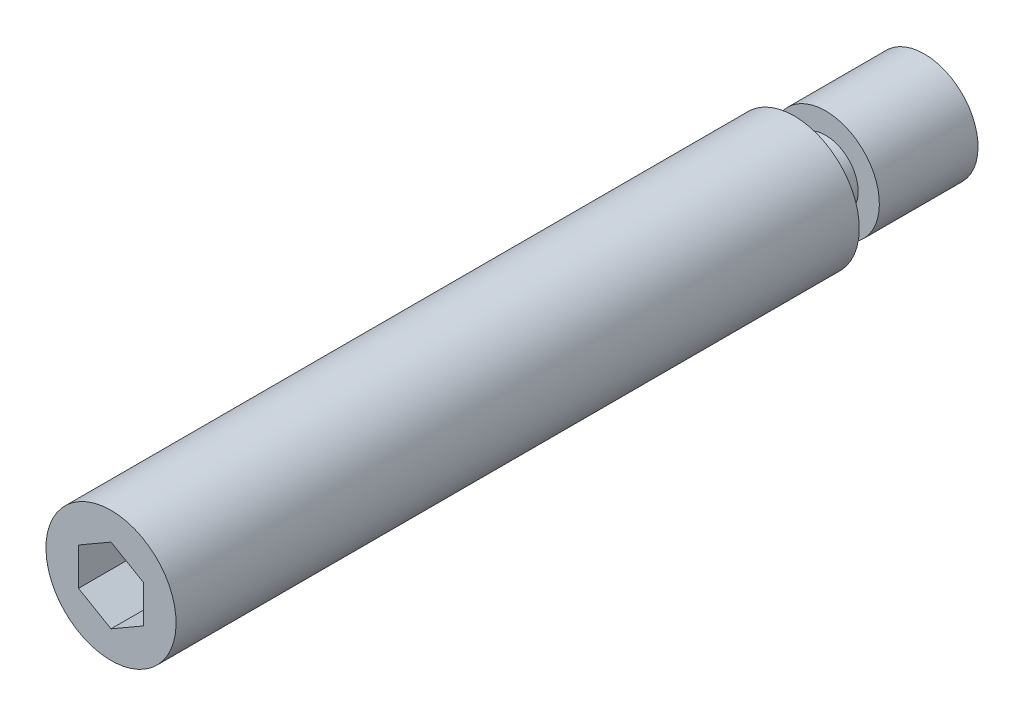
ISO-10303-21;
HEADER;
FILE_DESCRIPTION(('STEP AP214'),'2;1');
FILE_NAME('part.step','',(''),(''),'','','');
FILE_SCHEMA(('AUTOMOTIVE_DESIGN { 1 0 10303 214 1 1 1 1 }'));
ENDSEC;
DATA;
#1=APPLICATION_CONTEXT('core data for automotive mechanical design processes');
#2=APPLICATION_PROTOCOL_DEFINITION('international standard','automotive_design',2000,#1);
#3=PRODUCT_CONTEXT('',#1,'mechanical');
#4=PRODUCT('Part','Part','',(#3));
#5=PRODUCT_RELATED_PRODUCT_CATEGORY('part','',(#4));
#6=PRODUCT_DEFINITION_FORMATION('','',#4);
#7=PRODUCT_DEFINITION_CONTEXT('part definition',#1,'design');
#8=PRODUCT_DEFINITION('design','',#6,#7);
#9=PRODUCT_DEFINITION_SHAPE('','',#8);
#10=(LENGTH_UNIT() NAMED_UNIT(*) SI_UNIT(.MILLI.,.METRE.));
#11=(NAMED_UNIT(*) PLANE_ANGLE_UNIT() SI_UNIT($,.RADIAN.));
#12=(NAMED_UNIT(*) SI_UNIT($,.STERADIAN.) SOLID_ANGLE_UNIT());
#13=UNCERTAINTY_MEASURE_WITH_UNIT(LENGTH_MEASURE(1.E-05),#10,'distance_accuracy_value','');
#14=(GEOMETRIC_REPRESENTATION_CONTEXT(3) GLOBAL_UNCERTAINTY_ASSIGNED_CONTEXT((#13)) GLOBAL_UNIT_ASSIGNED_CONTEXT((#10,
#11,#12)) REPRESENTATION_CONTEXT('',''));
#15=CARTESIAN_POINT('',(0.,0.,0.));
#16=DIRECTION('',(0.,0.,1.));
#17=DIRECTION('',(1.,0.,0.));
#18=AXIS2_PLACEMENT_3D('',#15,#16,#17);
#19=CARTESIAN_POINT('',(0.,-6.,12.));
#20=DIRECTION('',(0.,0.,-1.));
#21=DIRECTION('',(0.,-1.,0.));
#22=AXIS2_PLACEMENT_3D('',#19,#20,#21);
#23=PLANE('',#22);
#24=CARTESIAN_POINT('',(0.,0.,12.));
#25=DIRECTION('',(0.,0.,1.));
#26=DIRECTION('',(0.,1.,0.));
#27=AXIS2_PLACEMENT_3D('',#24,#25,#26);
#28=CIRCLE('',#27,3.);
#29=CARTESIAN_POINT('',(0.,3.,12.));
#30=VERTEX_POINT('',#29);
#31=EDGE_CURVE('E115',#30,#30,#28,.T.);
#32=ORIENTED_EDGE('',*,*,#31,.T.);
#33=EDGE_LOOP('',(#32));
#34=FACE_BOUND('',#33,.T.);
#35=CARTESIAN_POINT('',(0.,0.,12.));
#36=DIRECTION('',(0.,0.,1.));
#37=DIRECTION('',(0.,1.,0.));
#38=AXIS2_PLACEMENT_3D('',#35,#36,#37);
#39=CIRCLE('',#38,6.);
#40=CARTESIAN_POINT('',(0.,6.,12.));
#41=VERTEX_POINT('',#40);
#42=EDGE_CURVE('E9',#41,#41,#39,.T.);
#43=ORIENTED_EDGE('',*,*,#42,.F.);
#44=EDGE_LOOP('',(#43));
#45=FACE_BOUND('',#44,.T.);
#46=ADVANCED_FACE('F14',(#34,#45),#23,.T.);
#47=CARTESIAN_POINT('',(0.,0.,20.));
#48=DIRECTION('',(0.,0.,1.));
#49=DIRECTION('',(0.,1.,0.));
#50=AXIS2_PLACEMENT_3D('',#47,#48,#49);
#51=CYLINDRICAL_SURFACE('',#50,6.);
#52=CARTESIAN_POINT('',(0.,0.,75.));
#53=DIRECTION('',(0.,0.,1.));
#54=DIRECTION('',(0.,1.,0.));
#55=AXIS2_PLACEMENT_3D('',#52,#53,#54);
#56=CIRCLE('',#55,6.);
#57=CARTESIAN_POINT('',(0.,6.,75.));
#58=VERTEX_POINT('',#57);
#59=EDGE_CURVE('E21',#58,#58,#56,.T.);
#60=ORIENTED_EDGE('',*,*,#59,.F.);
#61=EDGE_LOOP('',(#60));
#62=FACE_BOUND('',#61,.T.);
#63=ORIENTED_EDGE('',*,*,#42,.T.);
#64=EDGE_LOOP('',(#63));
#65=FACE_BOUND('',#64,.T.);
#66=ADVANCED_FACE('F136',(#62,#65),#51,.T.);
#67=CARTESIAN_POINT('',(0.,-6.,75.));
#68=DIRECTION('',(0.,0.,-1.));
#69=DIRECTION('',(0.,-1.,0.));
#70=AXIS2_PLACEMENT_3D('',#67,#68,#69);
#71=PLANE('',#70);
#72=DIRECTION('',(-0.866025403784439,-0.5,0.));
#73=VECTOR('',#72,1.);
#74=CARTESIAN_POINT('',(0.,3.46410161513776,75.));
#75=LINE('',#74,#73);
#76=CARTESIAN_POINT('',(0.,3.46410161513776,75.));
#77=VERTEX_POINT('',#76);
#78=CARTESIAN_POINT('',(-3.,1.73205080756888,75.));
#79=VERTEX_POINT('',#78);
#80=EDGE_CURVE('E102',#77,#79,#75,.T.);
#81=ORIENTED_EDGE('',*,*,#80,.F.);
#82=DIRECTION('',(-0.866025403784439,0.5,0.));
#83=VECTOR('',#82,1.);
#84=CARTESIAN_POINT('',(3.,1.73205080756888,75.));
#85=LINE('',#84,#83);
#86=CARTESIAN_POINT('',(3.,1.73205080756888,75.));
#87=VERTEX_POINT('',#86);
#88=EDGE_CURVE('E28',#87,#77,#85,.T.);
#89=ORIENTED_EDGE('',*,*,#88,.F.);
#90=DIRECTION('',(0.,1.,0.));
#91=VECTOR('',#90,1.);
#92=CARTESIAN_POINT('',(3.,-1.73205080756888,75.));
#93=LINE('',#92,#91);
#94=CARTESIAN_POINT('',(3.,-1.73205080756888,75.));
#95=VERTEX_POINT('',#94);
#96=EDGE_CURVE('E111',#95,#87,#93,.T.);
#97=ORIENTED_EDGE('',*,*,#96,.F.);
#98=DIRECTION('',(0.866025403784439,0.5,0.));
#99=VECTOR('',#98,1.);
#100=CARTESIAN_POINT('',(0.,-3.46410161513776,75.));
#101=LINE('',#100,#99);
#102=CARTESIAN_POINT('',(0.,-3.46410161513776,75.));
#103=VERTEX_POINT('',#102);
#104=EDGE_CURVE('E109',#103,#95,#101,.T.);
#105=ORIENTED_EDGE('',*,*,#104,.F.);
#106=DIRECTION('',(0.866025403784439,-0.5,0.));
#107=VECTOR('',#106,1.);
#108=CARTESIAN_POINT('',(-3.,-1.73205080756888,75.));
#109=LINE('',#108,#107);
#110=CARTESIAN_POINT('',(-3.,-1.73205080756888,75.));
#111=VERTEX_POINT('',#110);
#112=EDGE_CURVE('E76',#111,#103,#109,.T.);
#113=ORIENTED_EDGE('',*,*,#112,.F.);
#114=DIRECTION('',(0.,-1.,0.));
#115=VECTOR('',#114,1.);
#116=CARTESIAN_POINT('',(-3.,1.73205080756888,75.));
#117=LINE('',#116,#115);
#118=EDGE_CURVE('E105',#79,#111,#117,.T.);
#119=ORIENTED_EDGE('',*,*,#118,.F.);
#120=EDGE_LOOP('',(#81,#89,#97,#105,#113,#119));
#121=FACE_BOUND('',#120,.T.);
#122=ORIENTED_EDGE('',*,*,#59,.T.);
#123=EDGE_LOOP('',(#122));
#124=FACE_BOUND('',#123,.T.);
#125=ADVANCED_FACE('F134',(#121,#124),#71,.F.);
#126=CARTESIAN_POINT('',(0.,-4.95,0.));
#127=DIRECTION('',(0.,0.,-1.));
#128=DIRECTION('',(0.,-1.,0.));
#129=AXIS2_PLACEMENT_3D('',#126,#127,#128);
#130=PLANE('',#129);
#131=CARTESIAN_POINT('',(0.,0.,0.));
#132=DIRECTION('',(0.,0.,1.));
#133=DIRECTION('',(0.,1.,0.));
#134=AXIS2_PLACEMENT_3D('',#131,#132,#133);
#135=CIRCLE('',#134,4.95);
#136=CARTESIAN_POINT('',(0.,4.95,0.));
#137=VERTEX_POINT('',#136);
#138=EDGE_CURVE('E129',#137,#137,#135,.T.);
#139=ORIENTED_EDGE('',*,*,#138,.F.);
#140=EDGE_LOOP('',(#139));
#141=FACE_BOUND('',#140,.T.);
#142=ADVANCED_FACE('F167',(#141),#130,.T.);
#143=CARTESIAN_POINT('',(0.,0.,20.));
#144=DIRECTION('',(0.,0.,1.));
#145=DIRECTION('',(0.,1.,0.));
#146=AXIS2_PLACEMENT_3D('',#143,#144,#145);
#147=CYLINDRICAL_SURFACE('',#146,4.95);
#148=ORIENTED_EDGE('',*,*,#138,.T.);
#149=EDGE_LOOP('',(#148));
#150=FACE_BOUND('',#149,.T.);
#151=CARTESIAN_POINT('',(0.,0.,9.1));
#152=DIRECTION('',(0.,0.,1.));
#153=DIRECTION('',(0.,1.,0.));
#154=AXIS2_PLACEMENT_3D('',#151,#152,#153);
#155=CIRCLE('',#154,4.95);
#156=CARTESIAN_POINT('',(0.,4.95,9.1));
#157=VERTEX_POINT('',#156);
#158=EDGE_CURVE('E126',#157,#157,#155,.T.);
#159=ORIENTED_EDGE('',*,*,#158,.F.);
#160=EDGE_LOOP('',(#159));
#161=FACE_BOUND('',#160,.T.);
#162=ADVANCED_FACE('F160',(#150,#161),#147,.T.);
#163=CARTESIAN_POINT('',(0.,-3.,9.1));
#164=DIRECTION('',(0.,0.,1.));
#165=DIRECTION('',(0.,1.,0.));
#166=AXIS2_PLACEMENT_3D('',#163,#164,#165);
#167=PLANE('',#166);
#168=ORIENTED_EDGE('',*,*,#158,.T.);
#169=EDGE_LOOP('',(#168));
#170=FACE_BOUND('',#169,.T.);
#171=CARTESIAN_POINT('',(0.,0.,9.1));
#172=DIRECTION('',(0.,0.,1.));
#173=DIRECTION('',(0.,1.,0.));
#174=AXIS2_PLACEMENT_3D('',#171,#172,#173);
#175=CIRCLE('',#174,3.);
#176=CARTESIAN_POINT('',(0.,3.,9.1));
#177=VERTEX_POINT('',#176);
#178=EDGE_CURVE('E123',#177,#177,#175,.T.);
#179=ORIENTED_EDGE('',*,*,#178,.F.);
#180=EDGE_LOOP('',(#179));
#181=FACE_BOUND('',#180,.T.);
#182=ADVANCED_FACE('F151',(#170,#181),#167,.T.);
#183=CARTESIAN_POINT('',(0.,0.,20.));
#184=DIRECTION('',(0.,0.,1.));
#185=DIRECTION('',(0.,1.,0.));
#186=AXIS2_PLACEMENT_3D('',#183,#184,#185);
#187=CYLINDRICAL_SURFACE('',#186,3.);
#188=ORIENTED_EDGE('',*,*,#178,.T.);
#189=EDGE_LOOP('',(#188));
#190=FACE_BOUND('',#189,.T.);
#191=ORIENTED_EDGE('',*,*,#31,.F.);
#192=EDGE_LOOP('',(#191));
#193=FACE_BOUND('',#192,.T.);
#194=ADVANCED_FACE('F148',(#190,#193),#187,.T.);
#195=CARTESIAN_POINT('',(3.,1.73205080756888,67.));
#196=DIRECTION('',(0.5,0.866025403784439,0.));
#197=DIRECTION('',(-0.866025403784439,0.5,0.));
#198=AXIS2_PLACEMENT_3D('',#195,#196,#197);
#199=PLANE('',#198);
#200=ORIENTED_EDGE('',*,*,#88,.T.);
#201=DIRECTION('',(0.,0.,1.));
#202=VECTOR('',#201,1.);
#203=CARTESIAN_POINT('',(0.,3.46410161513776,67.));
#204=LINE('',#203,#202);
#205=CARTESIAN_POINT('',(0.,3.46410161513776,67.));
#206=VERTEX_POINT('',#205);
#207=EDGE_CURVE('E58',#206,#77,#204,.T.);
#208=ORIENTED_EDGE('',*,*,#207,.F.);
#209=DIRECTION('',(-0.866025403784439,0.5,0.));
#210=VECTOR('',#209,1.);
#211=CARTESIAN_POINT('',(3.,1.73205080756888,67.));
#212=LINE('',#211,#210);
#213=CARTESIAN_POINT('',(3.,1.73205080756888,67.));
#214=VERTEX_POINT('',#213);
#215=EDGE_CURVE('E113',#214,#206,#212,.T.);
#216=ORIENTED_EDGE('',*,*,#215,.F.);
#217=DIRECTION('',(0.,0.,1.));
#218=VECTOR('',#217,1.);
#219=CARTESIAN_POINT('',(3.,1.73205080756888,67.));
#220=LINE('',#219,#218);
#221=EDGE_CURVE('E36',#214,#87,#220,.T.);
#222=ORIENTED_EDGE('',*,*,#221,.T.);
#223=EDGE_LOOP('',(#200,#208,#216,#222));
#224=FACE_BOUND('',#223,.T.);
#225=ADVANCED_FACE('F150',(#224),#199,.F.);
#226=CARTESIAN_POINT('',(3.,-1.73205080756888,67.));
#227=DIRECTION('',(1.,0.,0.));
#228=DIRECTION('',(0.,0.,-1.));
#229=AXIS2_PLACEMENT_3D('',#226,#227,#228);
#230=PLANE('',#229);
#231=ORIENTED_EDGE('',*,*,#96,.T.);
#232=ORIENTED_EDGE('',*,*,#221,.F.);
#233=DIRECTION('',(0.,1.,0.));
#234=VECTOR('',#233,1.);
#235=CARTESIAN_POINT('',(3.,-1.73205080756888,67.));
#236=LINE('',#235,#234);
#237=CARTESIAN_POINT('',(3.,-1.73205080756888,67.));
#238=VERTEX_POINT('',#237);
#239=EDGE_CURVE('E88',#238,#214,#236,.T.);
#240=ORIENTED_EDGE('',*,*,#239,.F.);
#241=DIRECTION('',(0.,0.,1.));
#242=VECTOR('',#241,1.);
#243=CARTESIAN_POINT('',(3.,-1.73205080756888,67.));
#244=LINE('',#243,#242);
#245=EDGE_CURVE('E80',#238,#95,#244,.T.);
#246=ORIENTED_EDGE('',*,*,#245,.T.);
#247=EDGE_LOOP('',(#231,#232,#240,#246));
#248=FACE_BOUND('',#247,.T.);
#249=ADVANCED_FACE('F158',(#248),#230,.F.);
#250=CARTESIAN_POINT('',(0.,-3.46410161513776,67.));
#251=DIRECTION('',(0.5,-0.866025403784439,0.));
#252=DIRECTION('',(0.866025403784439,0.5,0.));
#253=AXIS2_PLACEMENT_3D('',#250,#251,#252);
#254=PLANE('',#253);
#255=ORIENTED_EDGE('',*,*,#104,.T.);
#256=ORIENTED_EDGE('',*,*,#245,.F.);
#257=DIRECTION('',(0.866025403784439,0.5,0.));
#258=VECTOR('',#257,1.);
#259=CARTESIAN_POINT('',(0.,-3.46410161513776,67.));
#260=LINE('',#259,#258);
#261=CARTESIAN_POINT('',(0.,-3.46410161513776,67.));
#262=VERTEX_POINT('',#261);
#263=EDGE_CURVE('E84',#262,#238,#260,.T.);
#264=ORIENTED_EDGE('',*,*,#263,.F.);
#265=DIRECTION('',(0.,0.,1.));
#266=VECTOR('',#265,1.);
#267=CARTESIAN_POINT('',(0.,-3.46410161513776,67.));
#268=LINE('',#267,#266);
#269=EDGE_CURVE('E69',#262,#103,#268,.T.);
#270=ORIENTED_EDGE('',*,*,#269,.T.);
#271=EDGE_LOOP('',(#255,#256,#264,#270));
#272=FACE_BOUND('',#271,.T.);
#273=ADVANCED_FACE('F85',(#272),#254,.F.);
#274=CARTESIAN_POINT('',(-3.,-1.73205080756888,67.));
#275=DIRECTION('',(-0.5,-0.866025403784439,0.));
#276=DIRECTION('',(0.866025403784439,-0.5,0.));
#277=AXIS2_PLACEMENT_3D('',#274,#275,#276);
#278=PLANE('',#277);
#279=ORIENTED_EDGE('',*,*,#112,.T.);
#280=ORIENTED_EDGE('',*,*,#269,.F.);
#281=DIRECTION('',(0.866025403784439,-0.5,0.));
#282=VECTOR('',#281,1.);
#283=CARTESIAN_POINT('',(-3.,-1.73205080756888,67.));
#284=LINE('',#283,#282);
#285=CARTESIAN_POINT('',(-3.,-1.73205080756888,67.));
#286=VERTEX_POINT('',#285);
#287=EDGE_CURVE('E73',#286,#262,#284,.T.);
#288=ORIENTED_EDGE('',*,*,#287,.F.);
#289=DIRECTION('',(0.,0.,1.));
#290=VECTOR('',#289,1.);
#291=CARTESIAN_POINT('',(-3.,-1.73205080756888,67.));
#292=LINE('',#291,#290);
#293=EDGE_CURVE('E81',#286,#111,#292,.T.);
#294=ORIENTED_EDGE('',*,*,#293,.T.);
#295=EDGE_LOOP('',(#279,#280,#288,#294));
#296=FACE_BOUND('',#295,.T.);
#297=ADVANCED_FACE('F71',(#296),#278,.F.);
#298=CARTESIAN_POINT('',(-3.,1.73205080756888,67.));
#299=DIRECTION('',(-1.,0.,0.));
#300=DIRECTION('',(0.,0.,1.));
#301=AXIS2_PLACEMENT_3D('',#298,#299,#300);
#302=PLANE('',#301);
#303=ORIENTED_EDGE('',*,*,#118,.T.);
#304=ORIENTED_EDGE('',*,*,#293,.F.);
#305=DIRECTION('',(0.,-1.,0.));
#306=VECTOR('',#305,1.);
#307=CARTESIAN_POINT('',(-3.,1.73205080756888,67.));
#308=LINE('',#307,#306);
#309=CARTESIAN_POINT('',(-3.,1.73205080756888,67.));
#310=VERTEX_POINT('',#309);
#311=EDGE_CURVE('E94',#310,#286,#308,.T.);
#312=ORIENTED_EDGE('',*,*,#311,.F.);
#313=DIRECTION('',(0.,0.,1.));
#314=VECTOR('',#313,1.);
#315=CARTESIAN_POINT('',(-3.,1.73205080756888,67.));
#316=LINE('',#315,#314);
#317=EDGE_CURVE('E118',#310,#79,#316,.T.);
#318=ORIENTED_EDGE('',*,*,#317,.T.);
#319=EDGE_LOOP('',(#303,#304,#312,#318));
#320=FACE_BOUND('',#319,.T.);
#321=ADVANCED_FACE('F192',(#320),#302,.F.);
#322=CARTESIAN_POINT('',(0.,3.46410161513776,67.));
#323=DIRECTION('',(-0.5,0.866025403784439,0.));
#324=DIRECTION('',(-0.866025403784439,-0.5,0.));
#325=AXIS2_PLACEMENT_3D('',#322,#323,#324);
#326=PLANE('',#325);
#327=ORIENTED_EDGE('',*,*,#80,.T.);
#328=ORIENTED_EDGE('',*,*,#317,.F.);
#329=DIRECTION('',(-0.866025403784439,-0.5,0.));
#330=VECTOR('',#329,1.);
#331=CARTESIAN_POINT('',(0.,3.46410161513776,67.));
#332=LINE('',#331,#330);
#333=EDGE_CURVE('E96',#206,#310,#332,.T.);
#334=ORIENTED_EDGE('',*,*,#333,.F.);
#335=ORIENTED_EDGE('',*,*,#207,.T.);
#336=EDGE_LOOP('',(#327,#328,#334,#335));
#337=FACE_BOUND('',#336,.T.);
#338=ADVANCED_FACE('F180',(#337),#326,.F.);
#339=CARTESIAN_POINT('',(0.,3.46410161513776,67.));
#340=DIRECTION('',(0.,0.,1.));
#341=DIRECTION('',(1.,0.,0.));
#342=AXIS2_PLACEMENT_3D('',#339,#340,#341);
#343=PLANE('',#342);
#344=ORIENTED_EDGE('',*,*,#215,.T.);
#345=ORIENTED_EDGE('',*,*,#333,.T.);
#346=ORIENTED_EDGE('',*,*,#311,.T.);
#347=ORIENTED_EDGE('',*,*,#287,.T.);
#348=ORIENTED_EDGE('',*,*,#263,.T.);
#349=ORIENTED_EDGE('',*,*,#239,.T.);
#350=EDGE_LOOP('',(#344,#345,#346,#347,#348,#349));
#351=FACE_BOUND('',#350,.T.);
#352=ADVANCED_FACE('F91',(#351),#343,.T.);
#353=CLOSED_SHELL('',(#46,#66,#125,#142,#162,#182,#194,#225,#249,#273,#297,#321,#338,#352));
#354=MANIFOLD_SOLID_BREP('B1',#353);
#355=ADVANCED_BREP_SHAPE_REPRESENTATION('',(#18,#354),#14);
#356=SHAPE_DEFINITION_REPRESENTATION(#9,#355);
ENDSEC;
END-ISO-10303-21;
